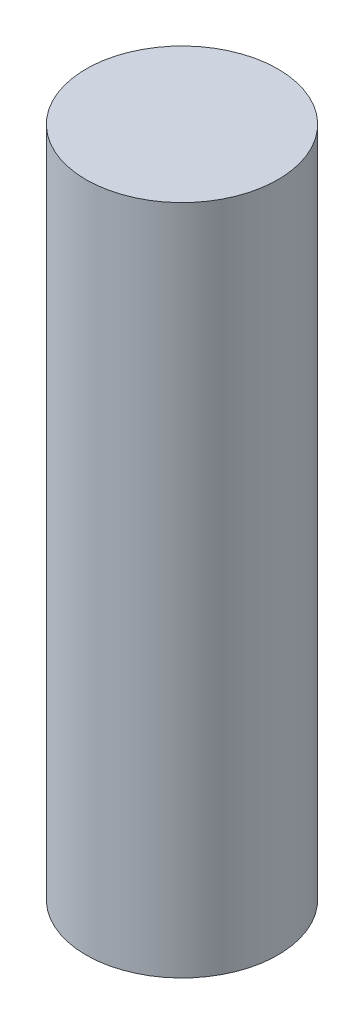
ISO-10303-21;
HEADER;
FILE_DESCRIPTION(('STEP AP214'),'2;1');
FILE_NAME('part.step','',(''),(''),'','','');
FILE_SCHEMA(('AUTOMOTIVE_DESIGN { 1 0 10303 214 1 1 1 1 }'));
ENDSEC;
DATA;
#1=APPLICATION_CONTEXT('core data for automotive mechanical design processes');
#2=APPLICATION_PROTOCOL_DEFINITION('international standard','automotive_design',2000,#1);
#3=PRODUCT_CONTEXT('',#1,'mechanical');
#4=PRODUCT('Part','Part','',(#3));
#5=PRODUCT_RELATED_PRODUCT_CATEGORY('part','',(#4));
#6=PRODUCT_DEFINITION_FORMATION('','',#4);
#7=PRODUCT_DEFINITION_CONTEXT('part definition',#1,'design');
#8=PRODUCT_DEFINITION('design','',#6,#7);
#9=PRODUCT_DEFINITION_SHAPE('','',#8);
#10=(LENGTH_UNIT() NAMED_UNIT(*) SI_UNIT(.MILLI.,.METRE.));
#11=(NAMED_UNIT(*) PLANE_ANGLE_UNIT() SI_UNIT($,.RADIAN.));
#12=(NAMED_UNIT(*) SI_UNIT($,.STERADIAN.) SOLID_ANGLE_UNIT());
#13=UNCERTAINTY_MEASURE_WITH_UNIT(LENGTH_MEASURE(1.E-05),#10,'distance_accuracy_value','');
#14=(GEOMETRIC_REPRESENTATION_CONTEXT(3) GLOBAL_UNCERTAINTY_ASSIGNED_CONTEXT((#13)) GLOBAL_UNIT_ASSIGNED_CONTEXT((#10,
#11,#12)) REPRESENTATION_CONTEXT('',''));
#15=CARTESIAN_POINT('',(0.,0.,0.));
#16=DIRECTION('',(0.,0.,1.));
#17=DIRECTION('',(1.,0.,0.));
#18=AXIS2_PLACEMENT_3D('',#15,#16,#17);
#19=CARTESIAN_POINT('',(0.,56.,0.));
#20=DIRECTION('',(0.,-1.,0.));
#21=DIRECTION('',(0.,0.,-1.));
#22=AXIS2_PLACEMENT_3D('',#19,#20,#21);
#23=CYLINDRICAL_SURFACE('',#22,8.);
#24=CARTESIAN_POINT('',(0.,56.,0.));
#25=DIRECTION('',(0.,1.,0.));
#26=DIRECTION('',(0.,0.,1.));
#27=AXIS2_PLACEMENT_3D('',#24,#25,#26);
#28=CIRCLE('',#27,8.);
#29=CARTESIAN_POINT('',(0.,56.,8.));
#30=VERTEX_POINT('',#29);
#31=EDGE_CURVE('E10',#30,#30,#28,.T.);
#32=ORIENTED_EDGE('',*,*,#31,.F.);
#33=EDGE_LOOP('',(#32));
#34=FACE_BOUND('',#33,.T.);
#35=CARTESIAN_POINT('',(0.,0.,0.));
#36=DIRECTION('',(0.,1.,0.));
#37=DIRECTION('',(0.,0.,1.));
#38=AXIS2_PLACEMENT_3D('',#35,#36,#37);
#39=CIRCLE('',#38,8.);
#40=CARTESIAN_POINT('',(0.,0.,8.));
#41=VERTEX_POINT('',#40);
#42=EDGE_CURVE('E40',#41,#41,#39,.T.);
#43=ORIENTED_EDGE('',*,*,#42,.T.);
#44=EDGE_LOOP('',(#43));
#45=FACE_BOUND('',#44,.T.);
#46=ADVANCED_FACE('F37',(#34,#45),#23,.T.);
#47=CARTESIAN_POINT('',(0.,56.,0.));
#48=DIRECTION('',(0.,1.,0.));
#49=DIRECTION('',(0.,0.,1.));
#50=AXIS2_PLACEMENT_3D('',#47,#48,#49);
#51=PLANE('',#50);
#52=ORIENTED_EDGE('',*,*,#31,.T.);
#53=EDGE_LOOP('',(#52));
#54=FACE_BOUND('',#53,.T.);
#55=ADVANCED_FACE('F54',(#54),#51,.T.);
#56=CARTESIAN_POINT('',(0.,0.,0.));
#57=DIRECTION('',(0.,1.,0.));
#58=DIRECTION('',(0.,0.,1.));
#59=AXIS2_PLACEMENT_3D('',#56,#57,#58);
#60=PLANE('',#59);
#61=ORIENTED_EDGE('',*,*,#42,.F.);
#62=EDGE_LOOP('',(#61));
#63=FACE_BOUND('',#62,.T.);
#64=ADVANCED_FACE('F52',(#63),#60,.F.);
#65=CLOSED_SHELL('',(#46,#55,#64));
#66=MANIFOLD_SOLID_BREP('B2',#65);
#67=ADVANCED_BREP_SHAPE_REPRESENTATION('',(#18,#66),#14);
#68=SHAPE_DEFINITION_REPRESENTATION(#9,#67);
ENDSEC;
END-ISO-10303-21;
